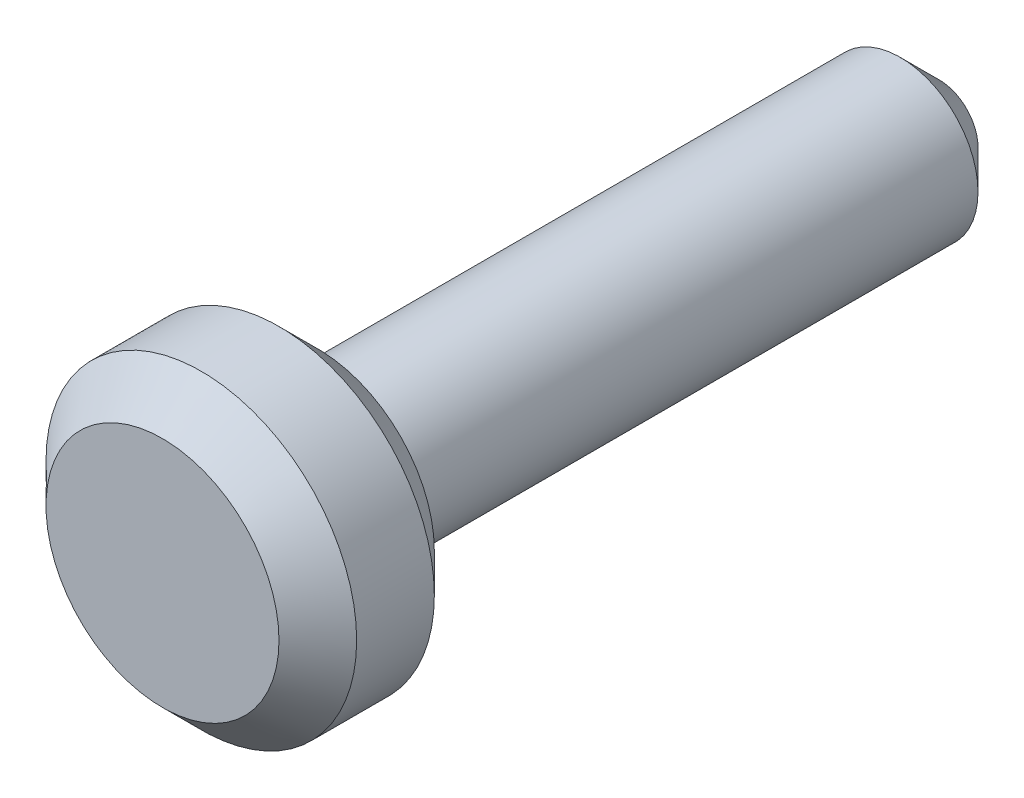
ISO-10303-21;
HEADER;
FILE_DESCRIPTION(('STEP AP214'),'2;1');
FILE_NAME('part.step','',(''),(''),'','','');
FILE_SCHEMA(('AUTOMOTIVE_DESIGN { 1 0 10303 214 1 1 1 1 }'));
ENDSEC;
DATA;
#1=APPLICATION_CONTEXT('core data for automotive mechanical design processes');
#2=APPLICATION_PROTOCOL_DEFINITION('international standard','automotive_design',2000,#1);
#3=PRODUCT_CONTEXT('',#1,'mechanical');
#4=PRODUCT('Part','Part','',(#3));
#5=PRODUCT_RELATED_PRODUCT_CATEGORY('part','',(#4));
#6=PRODUCT_DEFINITION_FORMATION('','',#4);
#7=PRODUCT_DEFINITION_CONTEXT('part definition',#1,'design');
#8=PRODUCT_DEFINITION('design','',#6,#7);
#9=PRODUCT_DEFINITION_SHAPE('','',#8);
#10=(LENGTH_UNIT() NAMED_UNIT(*) SI_UNIT(.MILLI.,.METRE.));
#11=(NAMED_UNIT(*) PLANE_ANGLE_UNIT() SI_UNIT($,.RADIAN.));
#12=(NAMED_UNIT(*) SI_UNIT($,.STERADIAN.) SOLID_ANGLE_UNIT());
#13=UNCERTAINTY_MEASURE_WITH_UNIT(LENGTH_MEASURE(1.E-05),#10,'distance_accuracy_value','');
#14=(GEOMETRIC_REPRESENTATION_CONTEXT(3) GLOBAL_UNCERTAINTY_ASSIGNED_CONTEXT((#13)) GLOBAL_UNIT_ASSIGNED_CONTEXT((#10,
#11,#12)) REPRESENTATION_CONTEXT('',''));
#15=CARTESIAN_POINT('',(0.,0.,0.));
#16=DIRECTION('',(0.,0.,1.));
#17=DIRECTION('',(1.,0.,0.));
#18=AXIS2_PLACEMENT_3D('',#15,#16,#17);
#19=CARTESIAN_POINT('',(0.,0.,8.));
#20=DIRECTION('',(0.,0.,-1.));
#21=DIRECTION('',(-1.,0.,0.));
#22=AXIS2_PLACEMENT_3D('',#19,#20,#21);
#23=CYLINDRICAL_SURFACE('',#22,1.);
#24=CARTESIAN_POINT('',(0.,0.,0.5));
#25=DIRECTION('',(0.,0.,1.));
#26=DIRECTION('',(1.,0.,0.));
#27=AXIS2_PLACEMENT_3D('',#24,#25,#26);
#28=CIRCLE('',#27,1.);
#29=CARTESIAN_POINT('',(1.,0.,0.5));
#30=VERTEX_POINT('',#29);
#31=EDGE_CURVE('E50',#30,#30,#28,.T.);
#32=ORIENTED_EDGE('',*,*,#31,.T.);
#33=EDGE_LOOP('',(#32));
#34=FACE_BOUND('',#33,.T.);
#35=CARTESIAN_POINT('',(0.,0.,8.));
#36=DIRECTION('',(0.,0.,1.));
#37=DIRECTION('',(1.,0.,0.));
#38=AXIS2_PLACEMENT_3D('',#35,#36,#37);
#39=CIRCLE('',#38,1.);
#40=CARTESIAN_POINT('',(1.,0.,8.));
#41=VERTEX_POINT('',#40);
#42=EDGE_CURVE('E53',#41,#41,#39,.T.);
#43=ORIENTED_EDGE('',*,*,#42,.F.);
#44=EDGE_LOOP('',(#43));
#45=FACE_BOUND('',#44,.T.);
#46=ADVANCED_FACE('F28',(#34,#45),#23,.T.);
#47=CARTESIAN_POINT('',(0.,0.,0.));
#48=DIRECTION('',(0.,0.,1.));
#49=DIRECTION('',(1.,0.,0.));
#50=AXIS2_PLACEMENT_3D('',#47,#48,#49);
#51=PLANE('',#50);
#52=CARTESIAN_POINT('',(0.,0.,0.));
#53=DIRECTION('',(0.,0.,1.));
#54=DIRECTION('',(1.,0.,0.));
#55=AXIS2_PLACEMENT_3D('',#52,#53,#54);
#56=CIRCLE('',#55,0.499999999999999);
#57=CARTESIAN_POINT('',(0.499999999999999,0.,0.));
#58=VERTEX_POINT('',#57);
#59=EDGE_CURVE('E47',#58,#58,#56,.F.);
#60=ORIENTED_EDGE('',*,*,#59,.T.);
#61=EDGE_LOOP('',(#60));
#62=FACE_BOUND('',#61,.T.);
#63=ADVANCED_FACE('F60',(#62),#51,.F.);
#64=CARTESIAN_POINT('',(0.,0.,8.));
#65=DIRECTION('',(0.,0.,1.));
#66=DIRECTION('',(1.,0.,0.));
#67=AXIS2_PLACEMENT_3D('',#64,#65,#66);
#68=PLANE('',#67);
#69=CARTESIAN_POINT('',(0.,0.,8.));
#70=DIRECTION('',(0.,0.,1.));
#71=DIRECTION('',(1.,0.,0.));
#72=AXIS2_PLACEMENT_3D('',#69,#70,#71);
#73=CIRCLE('',#72,1.5);
#74=CARTESIAN_POINT('',(1.5,0.,8.));
#75=VERTEX_POINT('',#74);
#76=EDGE_CURVE('E34',#75,#75,#73,.F.);
#77=ORIENTED_EDGE('',*,*,#76,.T.);
#78=EDGE_LOOP('',(#77));
#79=FACE_BOUND('',#78,.T.);
#80=ORIENTED_EDGE('',*,*,#42,.T.);
#81=EDGE_LOOP('',(#80));
#82=FACE_BOUND('',#81,.T.);
#83=ADVANCED_FACE('F57',(#79,#82),#68,.F.);
#84=CARTESIAN_POINT('',(0.,0.,10.));
#85=DIRECTION('',(0.,0.,-1.));
#86=DIRECTION('',(-1.,0.,0.));
#87=AXIS2_PLACEMENT_3D('',#84,#85,#86);
#88=CYLINDRICAL_SURFACE('',#87,2.);
#89=CARTESIAN_POINT('',(0.,0.,8.5));
#90=DIRECTION('',(0.,0.,1.));
#91=DIRECTION('',(1.,0.,0.));
#92=AXIS2_PLACEMENT_3D('',#89,#90,#91);
#93=CIRCLE('',#92,2.);
#94=CARTESIAN_POINT('',(2.,0.,8.5));
#95=VERTEX_POINT('',#94);
#96=EDGE_CURVE('E38',#95,#95,#93,.T.);
#97=ORIENTED_EDGE('',*,*,#96,.T.);
#98=EDGE_LOOP('',(#97));
#99=FACE_BOUND('',#98,.T.);
#100=CARTESIAN_POINT('',(0.,0.,9.5));
#101=DIRECTION('',(0.,0.,1.));
#102=DIRECTION('',(1.,0.,0.));
#103=AXIS2_PLACEMENT_3D('',#100,#101,#102);
#104=CIRCLE('',#103,2.);
#105=CARTESIAN_POINT('',(2.,0.,9.5));
#106=VERTEX_POINT('',#105);
#107=EDGE_CURVE('E42',#106,#106,#104,.F.);
#108=ORIENTED_EDGE('',*,*,#107,.T.);
#109=EDGE_LOOP('',(#108));
#110=FACE_BOUND('',#109,.T.);
#111=ADVANCED_FACE('F81',(#99,#110),#88,.T.);
#112=CARTESIAN_POINT('',(0.,0.,10.));
#113=DIRECTION('',(0.,0.,1.));
#114=DIRECTION('',(1.,0.,0.));
#115=AXIS2_PLACEMENT_3D('',#112,#113,#114);
#116=PLANE('',#115);
#117=CARTESIAN_POINT('',(0.,0.,10.));
#118=DIRECTION('',(0.,0.,1.));
#119=DIRECTION('',(1.,0.,0.));
#120=AXIS2_PLACEMENT_3D('',#117,#118,#119);
#121=CIRCLE('',#120,1.5);
#122=CARTESIAN_POINT('',(1.5,0.,10.));
#123=VERTEX_POINT('',#122);
#124=EDGE_CURVE('E10',#123,#123,#121,.T.);
#125=ORIENTED_EDGE('',*,*,#124,.T.);
#126=EDGE_LOOP('',(#125));
#127=FACE_BOUND('',#126,.T.);
#128=ADVANCED_FACE('F71',(#127),#116,.T.);
#129=CARTESIAN_POINT('',(0.,0.,0.5));
#130=DIRECTION('',(0.,0.,1.));
#131=DIRECTION('',(1.,0.,0.));
#132=AXIS2_PLACEMENT_3D('',#129,#130,#131);
#133=CONICAL_SURFACE('',#132,1.,0.785398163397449);
#134=ORIENTED_EDGE('',*,*,#59,.F.);
#135=EDGE_LOOP('',(#134));
#136=FACE_BOUND('',#135,.T.);
#137=ORIENTED_EDGE('',*,*,#31,.F.);
#138=EDGE_LOOP('',(#137));
#139=FACE_BOUND('',#138,.T.);
#140=ADVANCED_FACE('F68',(#136,#139),#133,.T.);
#141=CARTESIAN_POINT('',(0.,0.,8.5));
#142=DIRECTION('',(0.,0.,1.));
#143=DIRECTION('',(1.,0.,0.));
#144=AXIS2_PLACEMENT_3D('',#141,#142,#143);
#145=CONICAL_SURFACE('',#144,2.,0.78539816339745);
#146=ORIENTED_EDGE('',*,*,#76,.F.);
#147=EDGE_LOOP('',(#146));
#148=FACE_BOUND('',#147,.T.);
#149=ORIENTED_EDGE('',*,*,#96,.F.);
#150=EDGE_LOOP('',(#149));
#151=FACE_BOUND('',#150,.T.);
#152=ADVANCED_FACE('F70',(#148,#151),#145,.T.);
#153=CARTESIAN_POINT('',(0.,0.,10.));
#154=DIRECTION('',(0.,0.,-1.));
#155=DIRECTION('',(-1.,0.,0.));
#156=AXIS2_PLACEMENT_3D('',#153,#154,#155);
#157=CONICAL_SURFACE('',#156,1.5,0.785398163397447);
#158=ORIENTED_EDGE('',*,*,#107,.F.);
#159=EDGE_LOOP('',(#158));
#160=FACE_BOUND('',#159,.T.);
#161=ORIENTED_EDGE('',*,*,#124,.F.);
#162=EDGE_LOOP('',(#161));
#163=FACE_BOUND('',#162,.T.);
#164=ADVANCED_FACE('F78',(#160,#163),#157,.T.);
#165=CLOSED_SHELL('',(#46,#63,#83,#111,#128,#140,#152,#164));
#166=MANIFOLD_SOLID_BREP('B2',#165);
#167=ADVANCED_BREP_SHAPE_REPRESENTATION('',(#18,#166),#14);
#168=SHAPE_DEFINITION_REPRESENTATION(#9,#167);
ENDSEC;
END-ISO-10303-21;
